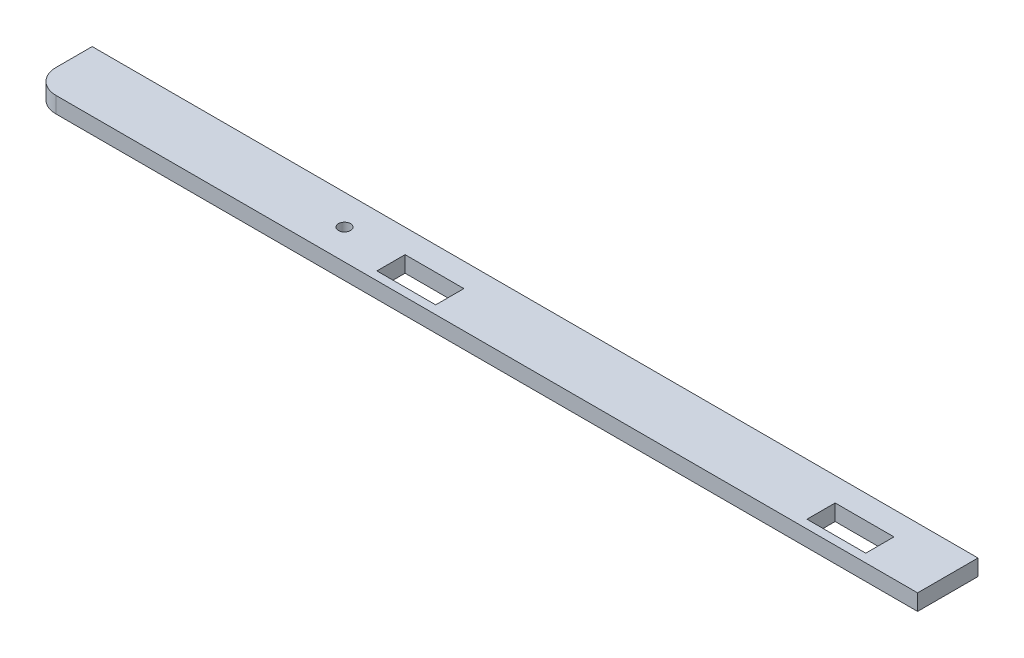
ISO-10303-21;
HEADER;
FILE_DESCRIPTION(('STEP AP214'),'2;1');
FILE_NAME('part.step','',(''),(''),'','','');
FILE_SCHEMA(('AUTOMOTIVE_DESIGN { 1 0 10303 214 1 1 1 1 }'));
ENDSEC;
DATA;
#1=APPLICATION_CONTEXT('core data for automotive mechanical design processes');
#2=APPLICATION_PROTOCOL_DEFINITION('international standard','automotive_design',2000,#1);
#3=PRODUCT_CONTEXT('',#1,'mechanical');
#4=PRODUCT('Part','Part','',(#3));
#5=PRODUCT_RELATED_PRODUCT_CATEGORY('part','',(#4));
#6=PRODUCT_DEFINITION_FORMATION('','',#4);
#7=PRODUCT_DEFINITION_CONTEXT('part definition',#1,'design');
#8=PRODUCT_DEFINITION('design','',#6,#7);
#9=PRODUCT_DEFINITION_SHAPE('','',#8);
#10=(LENGTH_UNIT() NAMED_UNIT(*) SI_UNIT(.MILLI.,.METRE.));
#11=(NAMED_UNIT(*) PLANE_ANGLE_UNIT() SI_UNIT($,.RADIAN.));
#12=(NAMED_UNIT(*) SI_UNIT($,.STERADIAN.) SOLID_ANGLE_UNIT());
#13=UNCERTAINTY_MEASURE_WITH_UNIT(LENGTH_MEASURE(1.E-05),#10,'distance_accuracy_value','');
#14=(GEOMETRIC_REPRESENTATION_CONTEXT(3) GLOBAL_UNCERTAINTY_ASSIGNED_CONTEXT((#13)) GLOBAL_UNIT_ASSIGNED_CONTEXT((#10,
#11,#12)) REPRESENTATION_CONTEXT('',''));
#15=CARTESIAN_POINT('',(0.,0.,0.));
#16=DIRECTION('',(0.,0.,1.));
#17=DIRECTION('',(1.,0.,0.));
#18=AXIS2_PLACEMENT_3D('',#15,#16,#17);
#19=CARTESIAN_POINT('',(-141.,-1.,106.));
#20=DIRECTION('',(-1.,0.,0.));
#21=DIRECTION('',(0.,0.,1.));
#22=AXIS2_PLACEMENT_3D('',#19,#20,#21);
#23=PLANE('',#22);
#24=DIRECTION('',(0.,0.,1.));
#25=VECTOR('',#24,1.);
#26=CARTESIAN_POINT('',(-141.,-1.,106.));
#27=LINE('',#26,#25);
#28=CARTESIAN_POINT('',(-141.,-1.,106.));
#29=VERTEX_POINT('',#28);
#30=CARTESIAN_POINT('',(-141.,-1.,115.));
#31=VERTEX_POINT('',#30);
#32=EDGE_CURVE('E180',#29,#31,#27,.T.);
#33=ORIENTED_EDGE('',*,*,#32,.T.);
#34=DIRECTION('',(0.,1.,0.));
#35=VECTOR('',#34,1.);
#36=CARTESIAN_POINT('',(-141.,-1.,115.));
#37=LINE('',#36,#35);
#38=CARTESIAN_POINT('',(-141.,3.,115.));
#39=VERTEX_POINT('',#38);
#40=EDGE_CURVE('E149',#31,#39,#37,.T.);
#41=ORIENTED_EDGE('',*,*,#40,.T.);
#42=DIRECTION('',(0.,0.,1.));
#43=VECTOR('',#42,1.);
#44=CARTESIAN_POINT('',(-141.,3.,106.));
#45=LINE('',#44,#43);
#46=CARTESIAN_POINT('',(-141.,3.,106.));
#47=VERTEX_POINT('',#46);
#48=EDGE_CURVE('E164',#47,#39,#45,.T.);
#49=ORIENTED_EDGE('',*,*,#48,.F.);
#50=DIRECTION('',(0.,1.,0.));
#51=VECTOR('',#50,1.);
#52=CARTESIAN_POINT('',(-141.,-1.,106.));
#53=LINE('',#52,#51);
#54=EDGE_CURVE('E198',#29,#47,#53,.T.);
#55=ORIENTED_EDGE('',*,*,#54,.F.);
#56=EDGE_LOOP('',(#33,#41,#49,#55));
#57=FACE_BOUND('',#56,.T.);
#58=ADVANCED_FACE('F35',(#57),#23,.T.);
#59=CARTESIAN_POINT('',(78.970675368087,-1.,106.));
#60=DIRECTION('',(0.,0.,-1.));
#61=DIRECTION('',(-1.,0.,0.));
#62=AXIS2_PLACEMENT_3D('',#59,#60,#61);
#63=PLANE('',#62);
#64=DIRECTION('',(-1.,0.,0.));
#65=VECTOR('',#64,1.);
#66=CARTESIAN_POINT('',(78.970675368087,3.,106.));
#67=LINE('',#66,#65);
#68=CARTESIAN_POINT('',(78.970675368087,3.,106.));
#69=VERTEX_POINT('',#68);
#70=EDGE_CURVE('E186',#69,#47,#67,.T.);
#71=ORIENTED_EDGE('',*,*,#70,.F.);
#72=DIRECTION('',(0.,1.,0.));
#73=VECTOR('',#72,1.);
#74=CARTESIAN_POINT('',(78.970675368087,-1.,106.));
#75=LINE('',#74,#73);
#76=CARTESIAN_POINT('',(78.970675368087,-1.,106.));
#77=VERTEX_POINT('',#76);
#78=EDGE_CURVE('E201',#77,#69,#75,.T.);
#79=ORIENTED_EDGE('',*,*,#78,.F.);
#80=DIRECTION('',(-1.,0.,0.));
#81=VECTOR('',#80,1.);
#82=CARTESIAN_POINT('',(78.970675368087,-1.,106.));
#83=LINE('',#82,#81);
#84=EDGE_CURVE('E192',#77,#29,#83,.T.);
#85=ORIENTED_EDGE('',*,*,#84,.T.);
#86=ORIENTED_EDGE('',*,*,#54,.T.);
#87=EDGE_LOOP('',(#71,#79,#85,#86));
#88=FACE_BOUND('',#87,.T.);
#89=ADVANCED_FACE('F246',(#88),#63,.T.);
#90=CARTESIAN_POINT('',(78.970675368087,-1.,121.));
#91=DIRECTION('',(1.,0.,0.));
#92=DIRECTION('',(0.,0.,-1.));
#93=AXIS2_PLACEMENT_3D('',#90,#91,#92);
#94=PLANE('',#93);
#95=DIRECTION('',(0.,0.,-1.));
#96=VECTOR('',#95,1.);
#97=CARTESIAN_POINT('',(78.970675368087,3.,121.));
#98=LINE('',#97,#96);
#99=CARTESIAN_POINT('',(78.970675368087,3.,121.));
#100=VERTEX_POINT('',#99);
#101=EDGE_CURVE('E189',#100,#69,#98,.T.);
#102=ORIENTED_EDGE('',*,*,#101,.F.);
#103=DIRECTION('',(0.,1.,0.));
#104=VECTOR('',#103,1.);
#105=CARTESIAN_POINT('',(78.970675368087,-1.,121.));
#106=LINE('',#105,#104);
#107=CARTESIAN_POINT('',(78.970675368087,-1.,121.));
#108=VERTEX_POINT('',#107);
#109=EDGE_CURVE('E204',#108,#100,#106,.T.);
#110=ORIENTED_EDGE('',*,*,#109,.F.);
#111=DIRECTION('',(0.,0.,-1.));
#112=VECTOR('',#111,1.);
#113=CARTESIAN_POINT('',(78.970675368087,-1.,121.));
#114=LINE('',#113,#112);
#115=EDGE_CURVE('E200',#108,#77,#114,.T.);
#116=ORIENTED_EDGE('',*,*,#115,.T.);
#117=ORIENTED_EDGE('',*,*,#78,.T.);
#118=EDGE_LOOP('',(#102,#110,#116,#117));
#119=FACE_BOUND('',#118,.T.);
#120=ADVANCED_FACE('F242',(#119),#94,.T.);
#121=CARTESIAN_POINT('',(-141.,-1.,121.));
#122=DIRECTION('',(0.,0.,1.));
#123=DIRECTION('',(1.,0.,0.));
#124=AXIS2_PLACEMENT_3D('',#121,#122,#123);
#125=PLANE('',#124);
#126=DIRECTION('',(1.,0.,0.));
#127=VECTOR('',#126,1.);
#128=CARTESIAN_POINT('',(-141.,3.,121.));
#129=LINE('',#128,#127);
#130=CARTESIAN_POINT('',(-135.,3.,121.));
#131=VERTEX_POINT('',#130);
#132=EDGE_CURVE('E187',#131,#100,#129,.T.);
#133=ORIENTED_EDGE('',*,*,#132,.F.);
#134=DIRECTION('',(0.,1.,0.));
#135=VECTOR('',#134,1.);
#136=CARTESIAN_POINT('',(-135.,-1.,121.));
#137=LINE('',#136,#135);
#138=CARTESIAN_POINT('',(-135.,-1.,121.));
#139=VERTEX_POINT('',#138);
#140=EDGE_CURVE('E43',#131,#139,#137,.F.);
#141=ORIENTED_EDGE('',*,*,#140,.T.);
#142=DIRECTION('',(1.,0.,0.));
#143=VECTOR('',#142,1.);
#144=CARTESIAN_POINT('',(-141.,-1.,121.));
#145=LINE('',#144,#143);
#146=EDGE_CURVE('E203',#139,#108,#145,.T.);
#147=ORIENTED_EDGE('',*,*,#146,.T.);
#148=ORIENTED_EDGE('',*,*,#109,.T.);
#149=EDGE_LOOP('',(#133,#141,#147,#148));
#150=FACE_BOUND('',#149,.T.);
#151=ADVANCED_FACE('F253',(#150),#125,.T.);
#152=CARTESIAN_POINT('',(0.,-1.,0.));
#153=DIRECTION('',(0.,1.,0.));
#154=DIRECTION('',(0.,0.,1.));
#155=AXIS2_PLACEMENT_3D('',#152,#153,#154);
#156=PLANE('',#155);
#157=DIRECTION('',(1.,0.,0.));
#158=VECTOR('',#157,1.);
#159=CARTESIAN_POINT('',(-57.4,-1.,111.9));
#160=LINE('',#159,#158);
#161=CARTESIAN_POINT('',(-57.4,-1.,111.9));
#162=VERTEX_POINT('',#161);
#163=CARTESIAN_POINT('',(-42.7999999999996,-1.,111.9));
#164=VERTEX_POINT('',#163);
#165=EDGE_CURVE('E144',#162,#164,#160,.T.);
#166=ORIENTED_EDGE('',*,*,#165,.F.);
#167=DIRECTION('',(0.,0.,-1.));
#168=VECTOR('',#167,1.);
#169=CARTESIAN_POINT('',(-57.4,-1.,111.9));
#170=LINE('',#169,#168);
#171=CARTESIAN_POINT('',(-57.4,-1.,118.9));
#172=VERTEX_POINT('',#171);
#173=EDGE_CURVE('E127',#172,#162,#170,.T.);
#174=ORIENTED_EDGE('',*,*,#173,.F.);
#175=DIRECTION('',(-1.,0.,0.));
#176=VECTOR('',#175,1.);
#177=CARTESIAN_POINT('',(-57.4,-1.,118.9));
#178=LINE('',#177,#176);
#179=CARTESIAN_POINT('',(-42.7999999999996,-1.,118.9));
#180=VERTEX_POINT('',#179);
#181=EDGE_CURVE('E210',#180,#172,#178,.T.);
#182=ORIENTED_EDGE('',*,*,#181,.F.);
#183=DIRECTION('',(0.,0.,1.));
#184=VECTOR('',#183,1.);
#185=CARTESIAN_POINT('',(-42.7999999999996,-1.,111.9));
#186=LINE('',#185,#184);
#187=EDGE_CURVE('E154',#164,#180,#186,.T.);
#188=ORIENTED_EDGE('',*,*,#187,.F.);
#189=EDGE_LOOP('',(#166,#174,#182,#188));
#190=FACE_BOUND('',#189,.T.);
#191=DIRECTION('',(-1.,0.,0.));
#192=VECTOR('',#191,1.);
#193=CARTESIAN_POINT('',(49.3999999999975,-1.,111.899999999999));
#194=LINE('',#193,#192);
#195=CARTESIAN_POINT('',(63.9999999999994,-1.,111.899999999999));
#196=VERTEX_POINT('',#195);
#197=CARTESIAN_POINT('',(49.3999999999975,-1.,111.899999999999));
#198=VERTEX_POINT('',#197);
#199=EDGE_CURVE('E206',#196,#198,#194,.T.);
#200=ORIENTED_EDGE('',*,*,#199,.T.);
#201=DIRECTION('',(0.,0.,1.));
#202=VECTOR('',#201,1.);
#203=CARTESIAN_POINT('',(49.3999999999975,-1.,111.899999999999));
#204=LINE('',#203,#202);
#205=CARTESIAN_POINT('',(49.3999999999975,-1.,118.9));
#206=VERTEX_POINT('',#205);
#207=EDGE_CURVE('E402',#198,#206,#204,.T.);
#208=ORIENTED_EDGE('',*,*,#207,.T.);
#209=DIRECTION('',(1.,0.,0.));
#210=VECTOR('',#209,1.);
#211=CARTESIAN_POINT('',(49.3999999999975,-1.,118.9));
#212=LINE('',#211,#210);
#213=CARTESIAN_POINT('',(63.9999999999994,-1.,118.899999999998));
#214=VERTEX_POINT('',#213);
#215=EDGE_CURVE('E407',#206,#214,#212,.T.);
#216=ORIENTED_EDGE('',*,*,#215,.T.);
#217=DIRECTION('',(0.,0.,-1.));
#218=VECTOR('',#217,1.);
#219=CARTESIAN_POINT('',(63.9999999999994,-1.,111.899999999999));
#220=LINE('',#219,#218);
#221=EDGE_CURVE('E406',#214,#196,#220,.T.);
#222=ORIENTED_EDGE('',*,*,#221,.T.);
#223=EDGE_LOOP('',(#200,#208,#216,#222));
#224=FACE_BOUND('',#223,.T.);
#225=CARTESIAN_POINT('',(-70.85,-1.,113.5));
#226=DIRECTION('',(0.,1.,0.));
#227=DIRECTION('',(0.,0.,1.));
#228=AXIS2_PLACEMENT_3D('',#225,#226,#227);
#229=CIRCLE('',#228,1.5);
#230=CARTESIAN_POINT('',(-70.85,-1.,115.));
#231=VERTEX_POINT('',#230);
#232=EDGE_CURVE('E171',#231,#231,#229,.T.);
#233=ORIENTED_EDGE('',*,*,#232,.T.);
#234=EDGE_LOOP('',(#233));
#235=FACE_BOUND('',#234,.T.);
#236=ORIENTED_EDGE('',*,*,#146,.F.);
#237=CARTESIAN_POINT('',(-135.,-1.,115.));
#238=DIRECTION('',(0.,1.,0.));
#239=DIRECTION('',(0.,0.,1.));
#240=AXIS2_PLACEMENT_3D('',#237,#238,#239);
#241=CIRCLE('',#240,6.);
#242=EDGE_CURVE('E11',#139,#31,#241,.F.);
#243=ORIENTED_EDGE('',*,*,#242,.T.);
#244=ORIENTED_EDGE('',*,*,#32,.F.);
#245=ORIENTED_EDGE('',*,*,#84,.F.);
#246=ORIENTED_EDGE('',*,*,#115,.F.);
#247=EDGE_LOOP('',(#236,#243,#244,#245,#246));
#248=FACE_BOUND('',#247,.T.);
#249=ADVANCED_FACE('F151',(#190,#224,#235,#248),#156,.F.);
#250=CARTESIAN_POINT('',(0.,3.,0.));
#251=DIRECTION('',(0.,1.,0.));
#252=DIRECTION('',(0.,0.,1.));
#253=AXIS2_PLACEMENT_3D('',#250,#251,#252);
#254=PLANE('',#253);
#255=DIRECTION('',(0.,0.,-1.));
#256=VECTOR('',#255,1.);
#257=CARTESIAN_POINT('',(-57.4,3.,111.9));
#258=LINE('',#257,#256);
#259=CARTESIAN_POINT('',(-57.4,3.,118.9));
#260=VERTEX_POINT('',#259);
#261=CARTESIAN_POINT('',(-57.4,3.,111.9));
#262=VERTEX_POINT('',#261);
#263=EDGE_CURVE('E169',#260,#262,#258,.T.);
#264=ORIENTED_EDGE('',*,*,#263,.T.);
#265=DIRECTION('',(1.,0.,0.));
#266=VECTOR('',#265,1.);
#267=CARTESIAN_POINT('',(-57.4,3.,111.9));
#268=LINE('',#267,#266);
#269=CARTESIAN_POINT('',(-42.7999999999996,3.,111.9));
#270=VERTEX_POINT('',#269);
#271=EDGE_CURVE('E147',#262,#270,#268,.T.);
#272=ORIENTED_EDGE('',*,*,#271,.T.);
#273=DIRECTION('',(0.,0.,1.));
#274=VECTOR('',#273,1.);
#275=CARTESIAN_POINT('',(-42.7999999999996,3.,111.9));
#276=LINE('',#275,#274);
#277=CARTESIAN_POINT('',(-42.7999999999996,3.,118.9));
#278=VERTEX_POINT('',#277);
#279=EDGE_CURVE('E165',#270,#278,#276,.T.);
#280=ORIENTED_EDGE('',*,*,#279,.T.);
#281=DIRECTION('',(-1.,0.,0.));
#282=VECTOR('',#281,1.);
#283=CARTESIAN_POINT('',(-57.4,3.,118.9));
#284=LINE('',#283,#282);
#285=EDGE_CURVE('E161',#278,#260,#284,.T.);
#286=ORIENTED_EDGE('',*,*,#285,.T.);
#287=EDGE_LOOP('',(#264,#272,#280,#286));
#288=FACE_BOUND('',#287,.T.);
#289=DIRECTION('',(0.,0.,1.));
#290=VECTOR('',#289,1.);
#291=CARTESIAN_POINT('',(49.3999999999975,3.,111.899999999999));
#292=LINE('',#291,#290);
#293=CARTESIAN_POINT('',(49.3999999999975,3.,111.899999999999));
#294=VERTEX_POINT('',#293);
#295=CARTESIAN_POINT('',(49.3999999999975,3.,118.9));
#296=VERTEX_POINT('',#295);
#297=EDGE_CURVE('E225',#294,#296,#292,.T.);
#298=ORIENTED_EDGE('',*,*,#297,.F.);
#299=DIRECTION('',(-1.,0.,0.));
#300=VECTOR('',#299,1.);
#301=CARTESIAN_POINT('',(49.3999999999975,3.,111.899999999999));
#302=LINE('',#301,#300);
#303=CARTESIAN_POINT('',(63.9999999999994,3.,111.899999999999));
#304=VERTEX_POINT('',#303);
#305=EDGE_CURVE('E393',#304,#294,#302,.T.);
#306=ORIENTED_EDGE('',*,*,#305,.F.);
#307=DIRECTION('',(0.,0.,-1.));
#308=VECTOR('',#307,1.);
#309=CARTESIAN_POINT('',(63.9999999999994,3.,111.899999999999));
#310=LINE('',#309,#308);
#311=CARTESIAN_POINT('',(63.9999999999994,3.,118.899999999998));
#312=VERTEX_POINT('',#311);
#313=EDGE_CURVE('E391',#312,#304,#310,.T.);
#314=ORIENTED_EDGE('',*,*,#313,.F.);
#315=DIRECTION('',(1.,0.,0.));
#316=VECTOR('',#315,1.);
#317=CARTESIAN_POINT('',(49.3999999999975,3.,118.9));
#318=LINE('',#317,#316);
#319=EDGE_CURVE('E384',#296,#312,#318,.T.);
#320=ORIENTED_EDGE('',*,*,#319,.F.);
#321=EDGE_LOOP('',(#298,#306,#314,#320));
#322=FACE_BOUND('',#321,.T.);
#323=CARTESIAN_POINT('',(-70.85,3.,113.5));
#324=DIRECTION('',(0.,1.,0.));
#325=DIRECTION('',(0.,0.,1.));
#326=AXIS2_PLACEMENT_3D('',#323,#324,#325);
#327=CIRCLE('',#326,1.5);
#328=CARTESIAN_POINT('',(-70.85,3.,115.));
#329=VERTEX_POINT('',#328);
#330=EDGE_CURVE('E197',#329,#329,#327,.T.);
#331=ORIENTED_EDGE('',*,*,#330,.F.);
#332=EDGE_LOOP('',(#331));
#333=FACE_BOUND('',#332,.T.);
#334=ORIENTED_EDGE('',*,*,#48,.T.);
#335=CARTESIAN_POINT('',(-135.,3.,115.));
#336=DIRECTION('',(0.,1.,0.));
#337=DIRECTION('',(0.,0.,1.));
#338=AXIS2_PLACEMENT_3D('',#335,#336,#337);
#339=CIRCLE('',#338,6.);
#340=EDGE_CURVE('E57',#39,#131,#339,.T.);
#341=ORIENTED_EDGE('',*,*,#340,.T.);
#342=ORIENTED_EDGE('',*,*,#132,.T.);
#343=ORIENTED_EDGE('',*,*,#101,.T.);
#344=ORIENTED_EDGE('',*,*,#70,.T.);
#345=EDGE_LOOP('',(#334,#341,#342,#343,#344));
#346=FACE_BOUND('',#345,.T.);
#347=ADVANCED_FACE('F183',(#288,#322,#333,#346),#254,.T.);
#348=CARTESIAN_POINT('',(-70.85,-1.,113.5));
#349=DIRECTION('',(0.,1.,0.));
#350=DIRECTION('',(0.,0.,1.));
#351=AXIS2_PLACEMENT_3D('',#348,#349,#350);
#352=CYLINDRICAL_SURFACE('',#351,1.5);
#353=ORIENTED_EDGE('',*,*,#232,.F.);
#354=EDGE_LOOP('',(#353));
#355=FACE_BOUND('',#354,.T.);
#356=ORIENTED_EDGE('',*,*,#330,.T.);
#357=EDGE_LOOP('',(#356));
#358=FACE_BOUND('',#357,.T.);
#359=ADVANCED_FACE('F219',(#355,#358),#352,.F.);
#360=CARTESIAN_POINT('',(49.3999999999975,-1.,111.899999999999));
#361=DIRECTION('',(-1.,0.,0.));
#362=DIRECTION('',(0.,0.,1.));
#363=AXIS2_PLACEMENT_3D('',#360,#361,#362);
#364=PLANE('',#363);
#365=ORIENTED_EDGE('',*,*,#297,.T.);
#366=DIRECTION('',(0.,1.,0.));
#367=VECTOR('',#366,1.);
#368=CARTESIAN_POINT('',(49.3999999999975,-1.,118.9));
#369=LINE('',#368,#367);
#370=EDGE_CURVE('E138',#206,#296,#369,.T.);
#371=ORIENTED_EDGE('',*,*,#370,.F.);
#372=ORIENTED_EDGE('',*,*,#207,.F.);
#373=DIRECTION('',(0.,1.,0.));
#374=VECTOR('',#373,1.);
#375=CARTESIAN_POINT('',(49.3999999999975,-1.,111.899999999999));
#376=LINE('',#375,#374);
#377=EDGE_CURVE('E230',#198,#294,#376,.T.);
#378=ORIENTED_EDGE('',*,*,#377,.T.);
#379=EDGE_LOOP('',(#365,#371,#372,#378));
#380=FACE_BOUND('',#379,.T.);
#381=ADVANCED_FACE('F285',(#380),#364,.F.);
#382=CARTESIAN_POINT('',(49.3999999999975,-1.,111.899999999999));
#383=DIRECTION('',(0.,0.,-1.));
#384=DIRECTION('',(-1.,0.,0.));
#385=AXIS2_PLACEMENT_3D('',#382,#383,#384);
#386=PLANE('',#385);
#387=ORIENTED_EDGE('',*,*,#305,.T.);
#388=ORIENTED_EDGE('',*,*,#377,.F.);
#389=ORIENTED_EDGE('',*,*,#199,.F.);
#390=DIRECTION('',(0.,1.,0.));
#391=VECTOR('',#390,1.);
#392=CARTESIAN_POINT('',(63.9999999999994,-1.,111.899999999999));
#393=LINE('',#392,#391);
#394=EDGE_CURVE('E394',#196,#304,#393,.T.);
#395=ORIENTED_EDGE('',*,*,#394,.T.);
#396=EDGE_LOOP('',(#387,#388,#389,#395));
#397=FACE_BOUND('',#396,.T.);
#398=ADVANCED_FACE('F293',(#397),#386,.F.);
#399=CARTESIAN_POINT('',(63.9999999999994,-1.,111.899999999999));
#400=DIRECTION('',(1.,0.,0.));
#401=DIRECTION('',(0.,0.,-1.));
#402=AXIS2_PLACEMENT_3D('',#399,#400,#401);
#403=PLANE('',#402);
#404=ORIENTED_EDGE('',*,*,#313,.T.);
#405=ORIENTED_EDGE('',*,*,#394,.F.);
#406=ORIENTED_EDGE('',*,*,#221,.F.);
#407=DIRECTION('',(0.,1.,0.));
#408=VECTOR('',#407,1.);
#409=CARTESIAN_POINT('',(63.9999999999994,-1.,118.899999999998));
#410=LINE('',#409,#408);
#411=EDGE_CURVE('E387',#214,#312,#410,.T.);
#412=ORIENTED_EDGE('',*,*,#411,.T.);
#413=EDGE_LOOP('',(#404,#405,#406,#412));
#414=FACE_BOUND('',#413,.T.);
#415=ADVANCED_FACE('F300',(#414),#403,.F.);
#416=CARTESIAN_POINT('',(49.3999999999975,-1.,118.9));
#417=DIRECTION('',(0.,0.,1.));
#418=DIRECTION('',(1.,0.,0.));
#419=AXIS2_PLACEMENT_3D('',#416,#417,#418);
#420=PLANE('',#419);
#421=ORIENTED_EDGE('',*,*,#319,.T.);
#422=ORIENTED_EDGE('',*,*,#411,.F.);
#423=ORIENTED_EDGE('',*,*,#215,.F.);
#424=ORIENTED_EDGE('',*,*,#370,.T.);
#425=EDGE_LOOP('',(#421,#422,#423,#424));
#426=FACE_BOUND('',#425,.T.);
#427=ADVANCED_FACE('F263',(#426),#420,.F.);
#428=CARTESIAN_POINT('',(-57.4,3.,111.9));
#429=DIRECTION('',(-1.,0.,0.));
#430=DIRECTION('',(0.,0.,1.));
#431=AXIS2_PLACEMENT_3D('',#428,#429,#430);
#432=PLANE('',#431);
#433=ORIENTED_EDGE('',*,*,#173,.T.);
#434=DIRECTION('',(0.,-1.,0.));
#435=VECTOR('',#434,1.);
#436=CARTESIAN_POINT('',(-57.4,3.,111.9));
#437=LINE('',#436,#435);
#438=EDGE_CURVE('E131',#262,#162,#437,.T.);
#439=ORIENTED_EDGE('',*,*,#438,.F.);
#440=ORIENTED_EDGE('',*,*,#263,.F.);
#441=DIRECTION('',(0.,-1.,0.));
#442=VECTOR('',#441,1.);
#443=CARTESIAN_POINT('',(-57.4,3.,118.9));
#444=LINE('',#443,#442);
#445=EDGE_CURVE('E133',#260,#172,#444,.T.);
#446=ORIENTED_EDGE('',*,*,#445,.T.);
#447=EDGE_LOOP('',(#433,#439,#440,#446));
#448=FACE_BOUND('',#447,.T.);
#449=ADVANCED_FACE('F129',(#448),#432,.F.);
#450=CARTESIAN_POINT('',(-57.4,3.,118.9));
#451=DIRECTION('',(0.,0.,1.));
#452=DIRECTION('',(1.,0.,0.));
#453=AXIS2_PLACEMENT_3D('',#450,#451,#452);
#454=PLANE('',#453);
#455=ORIENTED_EDGE('',*,*,#181,.T.);
#456=ORIENTED_EDGE('',*,*,#445,.F.);
#457=ORIENTED_EDGE('',*,*,#285,.F.);
#458=DIRECTION('',(0.,-1.,0.));
#459=VECTOR('',#458,1.);
#460=CARTESIAN_POINT('',(-42.7999999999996,3.,118.9));
#461=LINE('',#460,#459);
#462=EDGE_CURVE('E208',#278,#180,#461,.T.);
#463=ORIENTED_EDGE('',*,*,#462,.T.);
#464=EDGE_LOOP('',(#455,#456,#457,#463));
#465=FACE_BOUND('',#464,.T.);
#466=ADVANCED_FACE('F212',(#465),#454,.F.);
#467=CARTESIAN_POINT('',(-42.7999999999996,3.,111.9));
#468=DIRECTION('',(1.,0.,0.));
#469=DIRECTION('',(0.,0.,-1.));
#470=AXIS2_PLACEMENT_3D('',#467,#468,#469);
#471=PLANE('',#470);
#472=ORIENTED_EDGE('',*,*,#187,.T.);
#473=ORIENTED_EDGE('',*,*,#462,.F.);
#474=ORIENTED_EDGE('',*,*,#279,.F.);
#475=DIRECTION('',(0.,-1.,0.));
#476=VECTOR('',#475,1.);
#477=CARTESIAN_POINT('',(-42.7999999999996,3.,111.9));
#478=LINE('',#477,#476);
#479=EDGE_CURVE('E155',#270,#164,#478,.T.);
#480=ORIENTED_EDGE('',*,*,#479,.T.);
#481=EDGE_LOOP('',(#472,#473,#474,#480));
#482=FACE_BOUND('',#481,.T.);
#483=ADVANCED_FACE('F215',(#482),#471,.F.);
#484=CARTESIAN_POINT('',(-57.4,3.,111.9));
#485=DIRECTION('',(0.,0.,-1.));
#486=DIRECTION('',(-1.,0.,0.));
#487=AXIS2_PLACEMENT_3D('',#484,#485,#486);
#488=PLANE('',#487);
#489=ORIENTED_EDGE('',*,*,#165,.T.);
#490=ORIENTED_EDGE('',*,*,#479,.F.);
#491=ORIENTED_EDGE('',*,*,#271,.F.);
#492=ORIENTED_EDGE('',*,*,#438,.T.);
#493=EDGE_LOOP('',(#489,#490,#491,#492));
#494=FACE_BOUND('',#493,.T.);
#495=ADVANCED_FACE('F142',(#494),#488,.F.);
#496=CARTESIAN_POINT('',(-135.,-1.,115.));
#497=DIRECTION('',(0.,1.,0.));
#498=DIRECTION('',(0.,0.,1.));
#499=AXIS2_PLACEMENT_3D('',#496,#497,#498);
#500=CYLINDRICAL_SURFACE('',#499,6.);
#501=ORIENTED_EDGE('',*,*,#242,.F.);
#502=ORIENTED_EDGE('',*,*,#140,.F.);
#503=ORIENTED_EDGE('',*,*,#340,.F.);
#504=ORIENTED_EDGE('',*,*,#40,.F.);
#505=EDGE_LOOP('',(#501,#502,#503,#504));
#506=FACE_BOUND('',#505,.T.);
#507=ADVANCED_FACE('F37',(#506),#500,.T.);
#508=CLOSED_SHELL('',(#58,#89,#120,#151,#249,#347,#359,#381,#398,#415,#427,#449,#466,#483,#495,#507));
#509=MANIFOLD_SOLID_BREP('B2',#508);
#510=ADVANCED_BREP_SHAPE_REPRESENTATION('',(#18,#509),#14);
#511=SHAPE_DEFINITION_REPRESENTATION(#9,#510);
ENDSEC;
END-ISO-10303-21;
